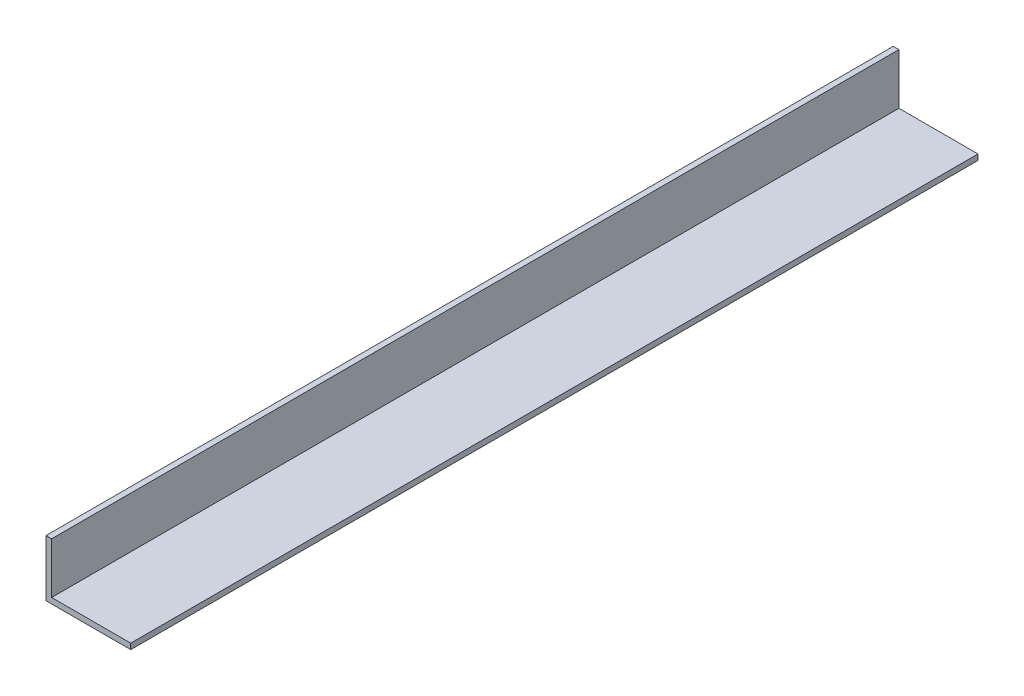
from build123d import *

# Parameters (mm, degrees)
EXTRUDE_1_DEPTH = 150


with BuildPart() as part:
    # Sketch 1 → Extrude 1 (new, symmetric)
    with BuildSketch(Plane.XY):
        Polygon((0, 0), (0, 18), (-2, 18), (-2, -2), (28, -2), (28, 0), align=None)
    extrude(amount=EXTRUDE_1_DEPTH, both=True)


solid = part.part
